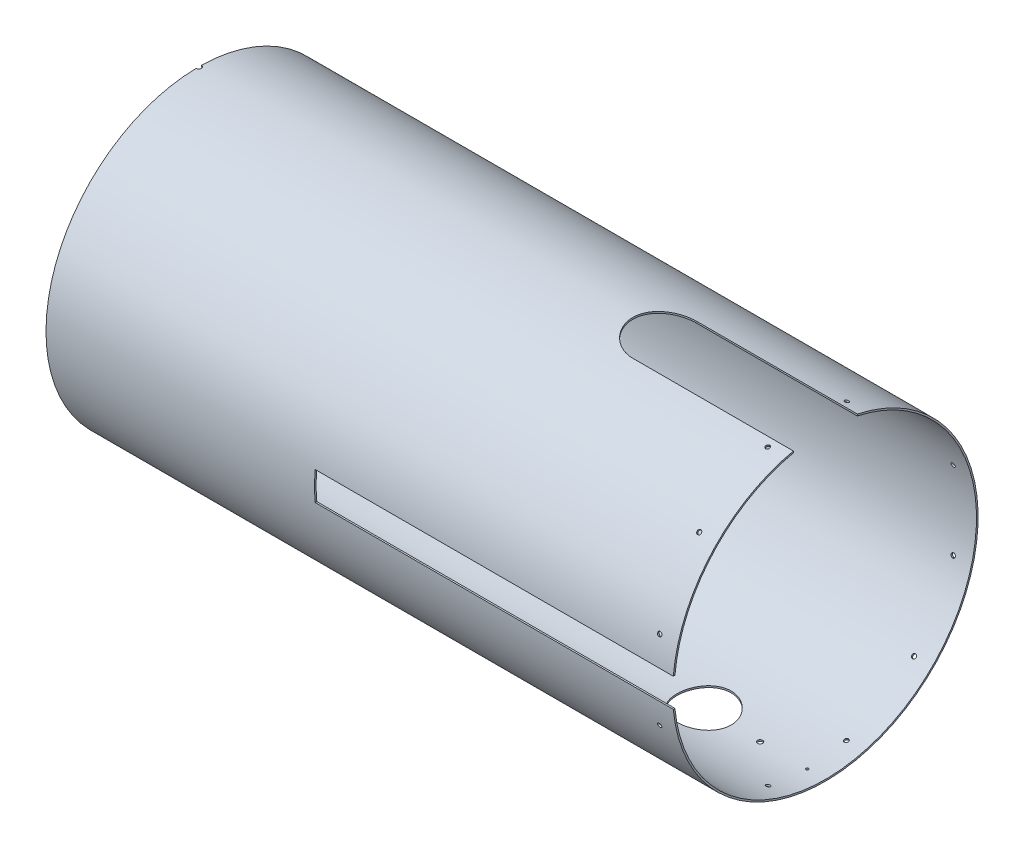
from build123d import *

# Parameters (mm, degrees)
SKETCH2_W                         = 464.652940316
SKETCH2_H                         = 34.798
CTD_CUT_DEPTH                     = 984.46489857
SKETCH4_R                         = 32.9565
EXTRUDE1_DEPTH                    = 984.46489857
SKETCH12_R                        = 2.5527
F_10_CUT_EXTRUDE2_DEPTH           = 984.464898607
CIRPATTERN1_COUNT                 = 12
INDEX_PIN_CUT_EXTRUDE4_DEPTH      = 984.464898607
INDEX_PIN_CUT_EXTRUDE4_DEPTH_BACK = 984.464898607
SKETCH14_R                        = 1.5875
DRAIN_HOLES_DEPTH                 = 984.464898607
DRAIN_HOLES_DEPTH_BACK            = 984.464898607
SKETCH17_R                        = 3.175
DAT_CUT_EXTRUDE6_DEPTH            = 984.464898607
DOME_CUT_EXTRUDE1_DEPTH           = 1012.030630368
DOME_CUT_EXTRUDE1_DEPTH_BACK      = 1012.030630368
SKETCH11_W                        = 323.593356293
SKETCH11_H                        = 549.462781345


with BuildPart() as part:
    # Sketch1 → Revolve1 (revolve)
    with BuildSketch(Plane.XY):
        with BuildLine():
            Line((0, 183.769), (-762, 183.769))
            ThreePointArc((-762, 183.769), (-867.786997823, 150.266950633), (-935.002950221, 61.976))
            ThreePointArc((-935.002950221, 61.976), (-943.057483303, 31.452076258), (-945.769, 0))
            Line((-945.769, 0), (-947.7375, 0))
            ThreePointArc((-947.7375, 0), (-945.332036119, 29.795694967), (-938.177950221, 58.819629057))
            ThreePointArc((-938.177950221, 58.819629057), (-870.566587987, 150.70406391), (-762, 185.7375))
            Line((-762, 185.7375), (0, 185.7375))
            Line((0, 185.7375), (0, 183.769))
        make_face()
    revolve(axis=Axis((0, 0, 0), (1, 0, 0)))

    # Sketch2 → CTD Cut (cut, through all)
    with BuildSketch(Plane(origin=(0, 0, 0), x_dir=(1, 0, 0), z_dir=(0, 0, -1))):
        with Locations((-203.131129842, 0)):
            Rectangle(SKETCH2_W, SKETCH2_H)
    extrude(amount=-CTD_CUT_DEPTH, mode=Mode.SUBTRACT)

    # Sketch4 → Extrude1 (cut, through all)
    with BuildSketch(Plane(origin=(0, 0, 0), x_dir=(1, 0, 0), z_dir=(0, 1, 0))):
        with Locations(Location((-147.6248, 0, 0), (0, 0, 270))):
            Circle(SKETCH4_R)
    extrude(amount=-EXTRUDE1_DEPTH, mode=Mode.SUBTRACT)

    # Sketch12 → 10 Cut-Extrude2 (cut, through all)
    with BuildSketch(Plane(origin=(0, 0, 0), x_dir=(-1, 0, 0), z_dir=(0, 0.9659258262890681, -0.25881904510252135))):
        with Locations(Location((22.0472, 0, 0), (0, 0, 270))):
            Circle(SKETCH12_R)
    f_10_cut_extrude2 = extrude(amount=F_10_CUT_EXTRUDE2_DEPTH, mode=Mode.SUBTRACT)

    # CirPattern1: 10 Cut-Extrude2 ×12 about axis
    cirpattern1_axis = Axis((0, 0, 0), (-1, 0, 0))
    for i in range(1, CIRPATTERN1_COUNT):
        add(f_10_cut_extrude2.rotate(cirpattern1_axis, i * 360 / CIRPATTERN1_COUNT), mode=Mode.SUBTRACT)

    # Sketch14 → Index Pin Cut-Extrude4 (cut, two sides: drawn at the far end of the back side and taken through both)
    with BuildSketch(Plane(origin=(0, 0, 0), x_dir=(1, 0, 0), z_dir=(0, 1, 0)).offset(-INDEX_PIN_CUT_EXTRUDE4_DEPTH_BACK)):
        with Locations(Location((-22.0472, 0, 0), (0, 0, 270))):
            Circle(SKETCH14_R)
    extrude(amount=INDEX_PIN_CUT_EXTRUDE4_DEPTH + INDEX_PIN_CUT_EXTRUDE4_DEPTH_BACK, mode=Mode.SUBTRACT)

    # Sketch17 → Drain Holes (cut, two sides: drawn at the far end of the back side and taken through both)
    with BuildSketch(Plane(origin=(0, 0, 0), x_dir=(1, 0, 0), z_dir=(0, 1, 0)).offset(-DRAIN_HOLES_DEPTH_BACK)):
        with Locations(Location((-79.375, 0, 0), (0, 0, 270))):
            Circle(SKETCH17_R)
        with Locations(Location((-762, 0, 0), (0, 0, 270))):
            Circle(SKETCH17_R)
    extrude(amount=DRAIN_HOLES_DEPTH + DRAIN_HOLES_DEPTH_BACK, mode=Mode.SUBTRACT)

    # Sketch16 → DAT Cut-Extrude6 (cut, through all)
    with BuildSketch(Plane(origin=(0, 0, 0), x_dir=(1, 0, 0), z_dir=(0, 1, 0))):
        with BuildLine():
            Line((-195.2625, 38.89375), (145.987534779, 38.89375))
            Line((145.987534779, 38.89375), (145.987534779, -38.89375))
            Line((145.987534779, -38.89375), (-195.2625, -38.89375))
            ThreePointArc((-195.2625, -38.89375), (-234.15625, 0), (-195.2625, 38.89375))
        make_face()
    extrude(amount=DAT_CUT_EXTRUDE6_DEPTH, mode=Mode.SUBTRACT)

    # Sketch11 → Dome Cut-Extrude1 (cut, two sides: drawn at the far end of the back side and taken through both)
    with BuildSketch(Plane(origin=(28.575, 0, 0), x_dir=(-1, 0, 0), z_dir=(0, 0, -1)).offset(-DOME_CUT_EXTRUDE1_DEPTH_BACK)):
        with Locations((952.371678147, 3.118994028)):
            Rectangle(SKETCH11_W, SKETCH11_H)
    extrude(amount=DOME_CUT_EXTRUDE1_DEPTH + DOME_CUT_EXTRUDE1_DEPTH_BACK, mode=Mode.SUBTRACT)


solid = part.part
